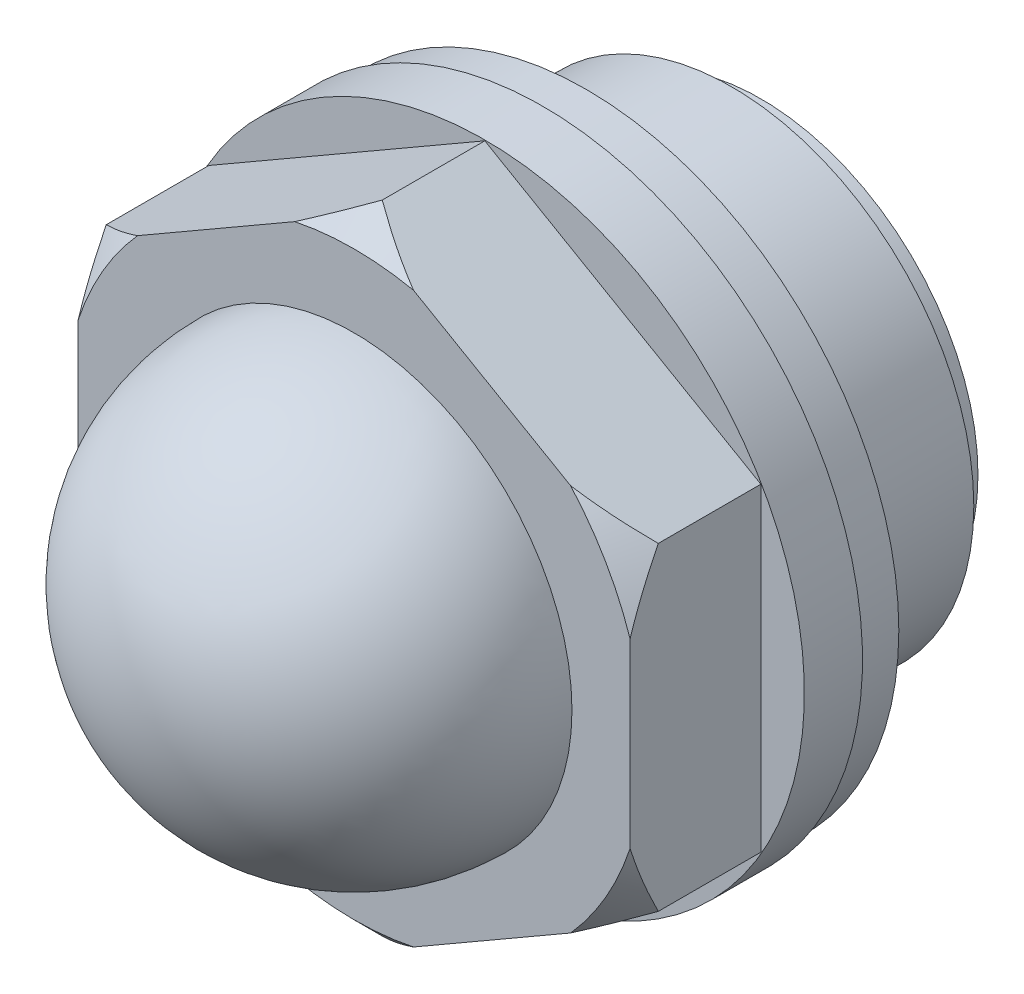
ISO-10303-21;
HEADER;
FILE_DESCRIPTION(('STEP AP214'),'2;1');
FILE_NAME('part.step','',(''),(''),'','','');
FILE_SCHEMA(('AUTOMOTIVE_DESIGN { 1 0 10303 214 1 1 1 1 }'));
ENDSEC;
DATA;
#1=APPLICATION_CONTEXT('core data for automotive mechanical design processes');
#2=APPLICATION_PROTOCOL_DEFINITION('international standard','automotive_design',2000,#1);
#3=PRODUCT_CONTEXT('',#1,'mechanical');
#4=PRODUCT('Part','Part','',(#3));
#5=PRODUCT_RELATED_PRODUCT_CATEGORY('part','',(#4));
#6=PRODUCT_DEFINITION_FORMATION('','',#4);
#7=PRODUCT_DEFINITION_CONTEXT('part definition',#1,'design');
#8=PRODUCT_DEFINITION('design','',#6,#7);
#9=PRODUCT_DEFINITION_SHAPE('','',#8);
#10=(LENGTH_UNIT() NAMED_UNIT(*) SI_UNIT(.MILLI.,.METRE.));
#11=(NAMED_UNIT(*) PLANE_ANGLE_UNIT() SI_UNIT($,.RADIAN.));
#12=(NAMED_UNIT(*) SI_UNIT($,.STERADIAN.) SOLID_ANGLE_UNIT());
#13=UNCERTAINTY_MEASURE_WITH_UNIT(LENGTH_MEASURE(1.E-05),#10,'distance_accuracy_value','');
#14=(GEOMETRIC_REPRESENTATION_CONTEXT(3) GLOBAL_UNCERTAINTY_ASSIGNED_CONTEXT((#13)) GLOBAL_UNIT_ASSIGNED_CONTEXT((#10,
#11,#12)) REPRESENTATION_CONTEXT('',''));
#15=CARTESIAN_POINT('',(0.,0.,0.));
#16=DIRECTION('',(0.,0.,1.));
#17=DIRECTION('',(1.,0.,0.));
#18=AXIS2_PLACEMENT_3D('',#15,#16,#17);
#19=CARTESIAN_POINT('',(0.,0.,-6.));
#20=DIRECTION('',(0.,0.,-1.));
#21=DIRECTION('',(-1.,0.,0.));
#22=AXIS2_PLACEMENT_3D('',#19,#20,#21);
#23=PLANE('',#22);
#24=CARTESIAN_POINT('',(0.,0.,-6.));
#25=DIRECTION('',(0.,0.,-1.));
#26=DIRECTION('',(-1.,0.,0.));
#27=AXIS2_PLACEMENT_3D('',#24,#25,#26);
#28=CIRCLE('',#27,7.475);
#29=CARTESIAN_POINT('',(-7.475,0.,-6.));
#30=VERTEX_POINT('',#29);
#31=EDGE_CURVE('E9',#30,#30,#28,.T.);
#32=ORIENTED_EDGE('',*,*,#31,.T.);
#33=EDGE_LOOP('',(#32));
#34=FACE_BOUND('',#33,.T.);
#35=ADVANCED_FACE('F14',(#34),#23,.T.);
#36=CARTESIAN_POINT('',(0.,0.,-10.25));
#37=DIRECTION('',(0.,0.,-1.));
#38=DIRECTION('',(-1.,0.,0.));
#39=AXIS2_PLACEMENT_3D('',#36,#37,#38);
#40=CYLINDRICAL_SURFACE('',#39,7.475);
#41=ORIENTED_EDGE('',*,*,#31,.F.);
#42=EDGE_LOOP('',(#41));
#43=FACE_BOUND('',#42,.T.);
#44=CARTESIAN_POINT('',(0.,0.,-5.));
#45=DIRECTION('',(0.,0.,-1.));
#46=DIRECTION('',(-1.,0.,0.));
#47=AXIS2_PLACEMENT_3D('',#44,#45,#46);
#48=CIRCLE('',#47,7.475);
#49=CARTESIAN_POINT('',(-7.475,0.,-5.));
#50=VERTEX_POINT('',#49);
#51=EDGE_CURVE('E21',#50,#50,#48,.T.);
#52=ORIENTED_EDGE('',*,*,#51,.T.);
#53=EDGE_LOOP('',(#52));
#54=FACE_BOUND('',#53,.T.);
#55=ADVANCED_FACE('F249',(#43,#54),#40,.T.);
#56=CARTESIAN_POINT('',(0.,7.475,-5.));
#57=DIRECTION('',(0.,0.,-1.));
#58=DIRECTION('',(-1.,0.,0.));
#59=AXIS2_PLACEMENT_3D('',#56,#57,#58);
#60=PLANE('',#59);
#61=CARTESIAN_POINT('',(0.,0.,-5.));
#62=DIRECTION('',(0.,0.,-1.));
#63=DIRECTION('',(-1.,0.,0.));
#64=AXIS2_PLACEMENT_3D('',#61,#62,#63);
#65=CIRCLE('',#64,8.331);
#66=CARTESIAN_POINT('',(-8.331,0.,-5.));
#67=VERTEX_POINT('',#66);
#68=EDGE_CURVE('E262',#67,#67,#65,.T.);
#69=ORIENTED_EDGE('',*,*,#68,.T.);
#70=EDGE_LOOP('',(#69));
#71=FACE_BOUND('',#70,.T.);
#72=ORIENTED_EDGE('',*,*,#51,.F.);
#73=EDGE_LOOP('',(#72));
#74=FACE_BOUND('',#73,.T.);
#75=ADVANCED_FACE('F255',(#71,#74),#60,.T.);
#76=CARTESIAN_POINT('',(0.,0.,-10.25));
#77=DIRECTION('',(0.,0.,-1.));
#78=DIRECTION('',(-1.,0.,0.));
#79=AXIS2_PLACEMENT_3D('',#76,#77,#78);
#80=CYLINDRICAL_SURFACE('',#79,8.331);
#81=ORIENTED_EDGE('',*,*,#68,.F.);
#82=EDGE_LOOP('',(#81));
#83=FACE_BOUND('',#82,.T.);
#84=CARTESIAN_POINT('',(0.,0.,0.));
#85=DIRECTION('',(0.,0.,-1.));
#86=DIRECTION('',(-1.,0.,0.));
#87=AXIS2_PLACEMENT_3D('',#84,#85,#86);
#88=CIRCLE('',#87,8.331);
#89=CARTESIAN_POINT('',(-8.331,0.,0.));
#90=VERTEX_POINT('',#89);
#91=EDGE_CURVE('E264',#90,#90,#88,.T.);
#92=ORIENTED_EDGE('',*,*,#91,.T.);
#93=EDGE_LOOP('',(#92));
#94=FACE_BOUND('',#93,.T.);
#95=ADVANCED_FACE('F494',(#83,#94),#80,.T.);
#96=CARTESIAN_POINT('',(0.,10.75,0.));
#97=DIRECTION('',(0.,0.,1.));
#98=DIRECTION('',(1.,0.,0.));
#99=AXIS2_PLACEMENT_3D('',#96,#97,#98);
#100=PLANE('',#99);
#101=ORIENTED_EDGE('',*,*,#91,.F.);
#102=EDGE_LOOP('',(#101));
#103=FACE_BOUND('',#102,.T.);
#104=CARTESIAN_POINT('',(0.,0.,0.));
#105=DIRECTION('',(0.,0.,-1.));
#106=DIRECTION('',(-1.,0.,0.));
#107=AXIS2_PLACEMENT_3D('',#104,#105,#106);
#108=CIRCLE('',#107,10.75);
#109=CARTESIAN_POINT('',(-10.75,0.,0.));
#110=VERTEX_POINT('',#109);
#111=EDGE_CURVE('E269',#110,#110,#108,.T.);
#112=ORIENTED_EDGE('',*,*,#111,.T.);
#113=EDGE_LOOP('',(#112));
#114=FACE_BOUND('',#113,.T.);
#115=ADVANCED_FACE('F484',(#103,#114),#100,.F.);
#116=CARTESIAN_POINT('',(0.,0.,-10.25));
#117=DIRECTION('',(0.,0.,-1.));
#118=DIRECTION('',(-1.,0.,0.));
#119=AXIS2_PLACEMENT_3D('',#116,#117,#118);
#120=CYLINDRICAL_SURFACE('',#119,10.75);
#121=CARTESIAN_POINT('',(0.,0.,1.5));
#122=DIRECTION('',(0.,0.,-1.));
#123=DIRECTION('',(-1.,0.,0.));
#124=AXIS2_PLACEMENT_3D('',#121,#122,#123);
#125=CIRCLE('',#124,10.75);
#126=CARTESIAN_POINT('',(-10.75,0.,1.5));
#127=VERTEX_POINT('',#126);
#128=EDGE_CURVE('E272',#127,#127,#125,.T.);
#129=ORIENTED_EDGE('',*,*,#128,.T.);
#130=EDGE_LOOP('',(#129));
#131=FACE_BOUND('',#130,.T.);
#132=ORIENTED_EDGE('',*,*,#111,.F.);
#133=EDGE_LOOP('',(#132));
#134=FACE_BOUND('',#133,.T.);
#135=ADVANCED_FACE('F474',(#131,#134),#120,.T.);
#136=CARTESIAN_POINT('',(0.,10.75,1.5));
#137=DIRECTION('',(0.,0.,-1.));
#138=DIRECTION('',(-1.,0.,0.));
#139=AXIS2_PLACEMENT_3D('',#136,#137,#138);
#140=PLANE('',#139);
#141=CARTESIAN_POINT('',(0.,0.,1.5));
#142=DIRECTION('',(0.,0.,-1.));
#143=DIRECTION('',(-1.,0.,0.));
#144=AXIS2_PLACEMENT_3D('',#141,#142,#143);
#145=CIRCLE('',#144,11.);
#146=CARTESIAN_POINT('',(-11.,0.,1.5));
#147=VERTEX_POINT('',#146);
#148=EDGE_CURVE('E275',#147,#147,#145,.T.);
#149=ORIENTED_EDGE('',*,*,#148,.T.);
#150=EDGE_LOOP('',(#149));
#151=FACE_BOUND('',#150,.T.);
#152=ORIENTED_EDGE('',*,*,#128,.F.);
#153=EDGE_LOOP('',(#152));
#154=FACE_BOUND('',#153,.T.);
#155=ADVANCED_FACE('F465',(#151,#154),#140,.T.);
#156=CARTESIAN_POINT('',(0.,0.,-10.25));
#157=DIRECTION('',(0.,0.,-1.));
#158=DIRECTION('',(-1.,0.,0.));
#159=AXIS2_PLACEMENT_3D('',#156,#157,#158);
#160=CYLINDRICAL_SURFACE('',#159,11.);
#161=ORIENTED_EDGE('',*,*,#148,.F.);
#162=EDGE_LOOP('',(#161));
#163=FACE_BOUND('',#162,.T.);
#164=CARTESIAN_POINT('',(0.,0.,3.5));
#165=DIRECTION('',(0.,0.,-1.));
#166=DIRECTION('',(-1.,0.,0.));
#167=AXIS2_PLACEMENT_3D('',#164,#165,#166);
#168=CIRCLE('',#167,11.);
#169=CARTESIAN_POINT('',(-11.,0.,3.5));
#170=VERTEX_POINT('',#169);
#171=EDGE_CURVE('E278',#170,#170,#168,.T.);
#172=ORIENTED_EDGE('',*,*,#171,.T.);
#173=EDGE_LOOP('',(#172));
#174=FACE_BOUND('',#173,.T.);
#175=ADVANCED_FACE('F246',(#163,#174),#160,.T.);
#176=CARTESIAN_POINT('',(0.,10.9696551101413,3.5));
#177=DIRECTION('',(0.,0.,-1.));
#178=DIRECTION('',(-1.,0.,0.));
#179=AXIS2_PLACEMENT_3D('',#176,#177,#178);
#180=PLANE('',#179);
#181=ORIENTED_EDGE('',*,*,#171,.F.);
#182=EDGE_LOOP('',(#181));
#183=FACE_BOUND('',#182,.T.);
#184=DIRECTION('',(0.,1.,0.));
#185=VECTOR('',#184,1.);
#186=CARTESIAN_POINT('',(-9.49999999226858,-5.4848275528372,3.5));
#187=LINE('',#186,#185);
#188=CARTESIAN_POINT('',(-9.49999999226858,-5.4848275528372,3.5));
#189=VERTEX_POINT('',#188);
#190=CARTESIAN_POINT('',(-9.49999999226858,5.4848275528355,3.5));
#191=VERTEX_POINT('',#190);
#192=EDGE_CURVE('E123',#189,#191,#187,.T.);
#193=ORIENTED_EDGE('',*,*,#192,.T.);
#194=DIRECTION('',(0.866025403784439,0.5,0.));
#195=VECTOR('',#194,1.);
#196=CARTESIAN_POINT('',(-9.49999999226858,5.4848275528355,3.5));
#197=LINE('',#196,#195);
#198=CARTESIAN_POINT('',(-3.86496390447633E-12,10.969655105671,3.5));
#199=VERTEX_POINT('',#198);
#200=EDGE_CURVE('E108',#191,#199,#197,.T.);
#201=ORIENTED_EDGE('',*,*,#200,.T.);
#202=DIRECTION('',(0.866025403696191,-0.50000000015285,0.));
#203=VECTOR('',#202,1.);
#204=CARTESIAN_POINT('',(-3.86496390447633E-12,10.969655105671,3.5));
#205=LINE('',#204,#203);
#206=CARTESIAN_POINT('',(9.49999999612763,5.48482754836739,3.5));
#207=VERTEX_POINT('',#206);
#208=EDGE_CURVE('E120',#199,#207,#205,.T.);
#209=ORIENTED_EDGE('',*,*,#208,.T.);
#210=DIRECTION('',(0.,-1.,0.));
#211=VECTOR('',#210,1.);
#212=CARTESIAN_POINT('',(9.49999999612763,5.48482754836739,3.5));
#213=LINE('',#212,#211);
#214=CARTESIAN_POINT('',(9.49999999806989,-5.48482755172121,3.5));
#215=VERTEX_POINT('',#214);
#216=EDGE_CURVE('E128',#207,#215,#213,.T.);
#217=ORIENTED_EDGE('',*,*,#216,.T.);
#218=DIRECTION('',(-0.866025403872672,-0.499999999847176,0.));
#219=VECTOR('',#218,1.);
#220=CARTESIAN_POINT('',(9.49999999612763,-5.4848275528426,3.5));
#221=LINE('',#220,#219);
#222=CARTESIAN_POINT('',(-1.5334955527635E-12,-10.969655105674,3.5));
#223=VERTEX_POINT('',#222);
#224=EDGE_CURVE('E28',#215,#223,#221,.T.);
#225=ORIENTED_EDGE('',*,*,#224,.T.);
#226=DIRECTION('',(-0.866025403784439,0.5,0.));
#227=VECTOR('',#226,1.);
#228=CARTESIAN_POINT('',(-1.5334955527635E-12,-10.969655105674,3.5));
#229=LINE('',#228,#227);
#230=EDGE_CURVE('E134',#223,#189,#229,.T.);
#231=ORIENTED_EDGE('',*,*,#230,.T.);
#232=EDGE_LOOP('',(#193,#201,#209,#217,#225,#231));
#233=FACE_BOUND('',#232,.T.);
#234=ADVANCED_FACE('F119',(#183,#233),#180,.F.);
#235=CARTESIAN_POINT('',(-9.49999999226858,5.4848275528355,3.5));
#236=DIRECTION('',(0.5,-0.866025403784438,0.));
#237=DIRECTION('',(-0.866025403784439,-0.5,0.));
#238=AXIS2_PLACEMENT_3D('',#235,#236,#237);
#239=PLANE('',#238);
#240=DIRECTION('',(0.,0.,1.));
#241=VECTOR('',#240,1.);
#242=CARTESIAN_POINT('',(-3.86496390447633E-12,10.969655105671,3.5));
#243=LINE('',#242,#241);
#244=CARTESIAN_POINT('',(-3.86496390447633E-12,10.969655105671,7.03034489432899));
#245=VERTEX_POINT('',#244);
#246=EDGE_CURVE('E104',#199,#245,#243,.T.);
#247=ORIENTED_EDGE('',*,*,#246,.F.);
#248=ORIENTED_EDGE('',*,*,#200,.F.);
#249=DIRECTION('',(0.,0.,1.));
#250=VECTOR('',#249,1.);
#251=CARTESIAN_POINT('',(-9.49999999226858,5.4848275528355,3.5));
#252=LINE('',#251,#250);
#253=CARTESIAN_POINT('',(-9.49999999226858,5.4848275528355,7.03034489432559));
#254=VERTEX_POINT('',#253);
#255=EDGE_CURVE('E137',#191,#254,#252,.T.);
#256=ORIENTED_EDGE('',*,*,#255,.T.);
#257=CARTESIAN_POINT('',(-3.88650780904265,8.72577877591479,8.44781919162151));
#258=CARTESIAN_POINT('',(-3.99076417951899,8.66558633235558,8.46038988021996));
#259=CARTESIAN_POINT('',(-4.09521487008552,8.60528169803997,8.47072263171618));
#260=CARTESIAN_POINT('',(-4.30438010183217,8.48452009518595,8.48683737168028));
#261=CARTESIAN_POINT('',(-4.40909464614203,8.42406312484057,8.49261930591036));
#262=CARTESIAN_POINT('',(-4.7233113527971,8.24265002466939,8.50302181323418));
#263=CARTESIAN_POINT('',(-4.93301802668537,8.12157582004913,8.50071508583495));
#264=CARTESIAN_POINT('',(-5.34769472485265,7.88216211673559,8.47791106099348));
#265=CARTESIAN_POINT('',(-5.5526794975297,7.76381410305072,8.45775761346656));
#266=CARTESIAN_POINT('',(-5.96082669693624,7.52817020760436,8.40051808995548));
#267=CARTESIAN_POINT('',(-6.16398926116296,7.41087424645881,8.36343330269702));
#268=CARTESIAN_POINT('',(-6.67178190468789,7.11770002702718,8.25042007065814));
#269=CARTESIAN_POINT('',(-6.97472889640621,6.94279349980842,8.16432263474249));
#270=CARTESIAN_POINT('',(-7.57318986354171,6.59727189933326,7.96169160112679));
#271=CARTESIAN_POINT('',(-7.86869179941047,6.42666377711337,7.84511178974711));
#272=CARTESIAN_POINT('',(-8.46039122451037,6.0850459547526,7.58350665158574));
#273=CARTESIAN_POINT('',(-8.75633407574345,5.91418326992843,7.4377210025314));
#274=CARTESIAN_POINT('',(-9.19346873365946,5.66180345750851,7.20399268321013));
#275=CARTESIAN_POINT('',(-9.33780587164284,5.57847037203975,7.12372709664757));
#276=CARTESIAN_POINT('',(-9.62448818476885,5.41295426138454,6.95869978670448));
#277=CARTESIAN_POINT('',(-9.76683394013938,5.33077090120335,6.87393940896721));
#278=CARTESIAN_POINT('',(-9.90826977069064,5.2491128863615,6.78719500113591));
#279=B_SPLINE_CURVE_WITH_KNOTS('',3,(#257,#258,#259,#260,#261,#262,#263,#264,#265,#266,#267,
#268,#269,#270,#271,#272,#273,#274,#275,#276,#277,#278),.UNSPECIFIED.,.F.,.F.,(4,2,2,2,2,2,2,2,
2,2,4),(0.,0.363077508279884,0.726159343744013,1.45186638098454,2.16388835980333,
2.87585615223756,3.95485073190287,5.03549073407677,6.14915016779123,6.70405849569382,
7.25880162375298),.UNSPECIFIED.);
#280=CARTESIAN_POINT('',(-7.45416347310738,6.6659918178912,8.));
#281=VERTEX_POINT('',#280);
#282=EDGE_CURVE('E225',#281,#254,#279,.T.);
#283=ORIENTED_EDGE('',*,*,#282,.F.);
#284=DIRECTION('',(0.866025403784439,0.5,0.));
#285=VECTOR('',#284,1.);
#286=CARTESIAN_POINT('',(-9.49999999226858,5.4848275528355,8.));
#287=LINE('',#286,#285);
#288=CARTESIAN_POINT('',(-2.04583651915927,9.7884908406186,8.));
#289=VERTEX_POINT('',#288);
#290=EDGE_CURVE('E298',#281,#289,#287,.T.);
#291=ORIENTED_EDGE('',*,*,#290,.T.);
#292=CARTESIAN_POINT('',(0.000199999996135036,10.9697705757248,7.03022942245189));
#293=CARTESIAN_POINT('',(-0.16497200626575,10.8744084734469,7.125577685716));
#294=CARTESIAN_POINT('',(-0.331450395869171,10.7782921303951,7.21798306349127));
#295=CARTESIAN_POINT('',(-0.666865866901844,10.5846399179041,7.39577132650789));
#296=CARTESIAN_POINT('',(-0.835798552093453,10.4871065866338,7.48116529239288));
#297=CARTESIAN_POINT('',(-1.17654218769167,10.2903781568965,7.64412782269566));
#298=CARTESIAN_POINT('',(-1.34835383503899,10.1911826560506,7.72169445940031));
#299=CARTESIAN_POINT('',(-1.69509608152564,9.9909909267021,7.86794743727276));
#300=CARTESIAN_POINT('',(-1.87003127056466,9.88999204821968,7.93661923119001));
#301=CARTESIAN_POINT('',(-2.0463912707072,9.78817055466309,8.0002));
#302=B_SPLINE_CURVE_WITH_KNOTS('',3,(#292,#293,#294,#295,#296,#297,#298,#299,#300,#301),
.UNSPECIFIED.,.F.,.F.,(4,2,2,2,4),(0.,0.639712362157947,1.27839345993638,1.91723147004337,
2.55710143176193),.UNSPECIFIED.);
#303=EDGE_CURVE('E110',#245,#289,#302,.T.);
#304=ORIENTED_EDGE('',*,*,#303,.F.);
#305=EDGE_LOOP('',(#247,#248,#256,#283,#291,#304));
#306=FACE_BOUND('',#305,.T.);
#307=ADVANCED_FACE('F106',(#306),#239,.F.);
#308=CARTESIAN_POINT('',(-3.86496390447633E-12,10.969655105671,3.5));
#309=DIRECTION('',(-0.50000000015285,-0.866025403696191,0.));
#310=DIRECTION('',(-0.866025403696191,0.50000000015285,0.));
#311=AXIS2_PLACEMENT_3D('',#308,#309,#310);
#312=PLANE('',#311);
#313=DIRECTION('',(0.,0.,1.));
#314=VECTOR('',#313,1.);
#315=CARTESIAN_POINT('',(9.49999999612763,5.48482754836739,3.5));
#316=LINE('',#315,#314);
#317=CARTESIAN_POINT('',(9.49999999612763,5.48482754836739,7.03034489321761));
#318=VERTEX_POINT('',#317);
#319=EDGE_CURVE('E114',#207,#318,#316,.T.);
#320=ORIENTED_EDGE('',*,*,#319,.F.);
#321=ORIENTED_EDGE('',*,*,#208,.F.);
#322=ORIENTED_EDGE('',*,*,#246,.T.);
#323=CARTESIAN_POINT('',(5.62744002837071,7.7206510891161,8.44612463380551));
#324=CARTESIAN_POINT('',(5.5232333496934,7.78081484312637,8.45888991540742));
#325=CARTESIAN_POINT('',(5.41882944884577,7.84109246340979,8.46942139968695));
#326=CARTESIAN_POINT('',(5.20975131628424,7.96180377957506,8.48594001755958));
#327=CARTESIAN_POINT('',(5.10507708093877,8.02223747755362,8.49192708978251));
#328=CARTESIAN_POINT('',(4.790968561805,8.20358811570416,8.50295158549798));
#329=CARTESIAN_POINT('',(4.58131953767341,8.32462903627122,8.50106822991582));
#330=CARTESIAN_POINT('',(4.16673966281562,8.56398683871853,8.47910352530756));
#331=CARTESIAN_POINT('',(3.96179455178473,8.68231195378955,8.45936693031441));
#332=CARTESIAN_POINT('',(3.55370330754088,8.91792354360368,8.40294779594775));
#333=CARTESIAN_POINT('',(3.35055703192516,9.03521010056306,8.36626661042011));
#334=CARTESIAN_POINT('',(2.8435182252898,9.32794909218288,8.25440004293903));
#335=CARTESIAN_POINT('',(2.54128241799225,9.50244501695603,8.16911639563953));
#336=CARTESIAN_POINT('',(1.94418390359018,9.84718000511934,7.96816990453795));
#337=CARTESIAN_POINT('',(1.64933310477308,10.0174121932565,7.85246107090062));
#338=CARTESIAN_POINT('',(1.05891214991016,10.3582918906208,7.59264131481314));
#339=CARTESIAN_POINT('',(0.763595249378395,10.5287931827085,7.44777064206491));
#340=CARTESIAN_POINT('',(0.327374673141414,10.7806452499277,7.21540819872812));
#341=CARTESIAN_POINT('',(0.183336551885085,10.8638056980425,7.13559538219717));
#342=CARTESIAN_POINT('',(-0.102753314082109,11.0289797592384,6.97147085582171));
#343=CARTESIAN_POINT('',(-0.244805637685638,11.1109937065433,6.88716049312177));
#344=CARTESIAN_POINT('',(-0.385950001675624,11.1924834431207,6.800864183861));
#345=B_SPLINE_CURVE_WITH_KNOTS('',3,(#323,#324,#325,#326,#327,#328,#329,#330,#331,#332,#333,
#334,#335,#336,#337,#338,#339,#340,#341,#342,#343,#344),.UNSPECIFIED.,.F.,.F.,(4,2,2,2,2,2,2,2,
2,2,4),(0.,0.362967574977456,0.725940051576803,1.45143701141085,2.16321655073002,
2.87493922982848,3.9509658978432,5.02862850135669,6.13921661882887,6.69260270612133,
7.24582395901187),.UNSPECIFIED.);
#346=CARTESIAN_POINT('',(2.04583651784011,9.7884908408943,8.));
#347=VERTEX_POINT('',#346);
#348=EDGE_CURVE('E212',#347,#245,#345,.T.);
#349=ORIENTED_EDGE('',*,*,#348,.F.);
#350=DIRECTION('',(0.866025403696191,-0.50000000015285,0.));
#351=VECTOR('',#350,1.);
#352=CARTESIAN_POINT('',(-3.86496390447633E-12,10.969655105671,8.));
#353=LINE('',#352,#351);
#354=CARTESIAN_POINT('',(7.45416347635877,6.6659918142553,8.));
#355=VERTEX_POINT('',#354);
#356=EDGE_CURVE('E300',#347,#355,#353,.T.);
#357=ORIENTED_EDGE('',*,*,#356,.T.);
#358=CARTESIAN_POINT('',(9.50019999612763,5.48471207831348,7.0302294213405));
#359=CARTESIAN_POINT('',(9.33502798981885,5.58007418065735,7.12557768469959));
#360=CARTESIAN_POINT('',(9.16854960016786,5.6761905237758,7.21798306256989));
#361=CARTESIAN_POINT('',(8.83313412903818,5.86984273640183,7.39577132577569));
#362=CARTESIAN_POINT('',(8.66420144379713,5.96737606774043,7.48116529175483));
#363=CARTESIAN_POINT('',(8.32345780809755,6.16410449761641,7.64412782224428));
#364=CARTESIAN_POINT('',(8.15164616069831,6.26329999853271,7.72169445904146));
#365=CARTESIAN_POINT('',(7.80490391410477,6.4634917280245,7.86794743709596));
#366=CARTESIAN_POINT('',(7.62996872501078,6.56449060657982,7.93661923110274));
#367=CARTESIAN_POINT('',(7.45360872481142,6.6663121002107,8.0002));
#368=B_SPLINE_CURVE_WITH_KNOTS('',3,(#358,#359,#360,#361,#362,#363,#364,#365,#366,#367),
.UNSPECIFIED.,.F.,.F.,(4,2,2,2,4),(0.,0.639712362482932,1.27839346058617,1.91723147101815,
2.55710143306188),.UNSPECIFIED.);
#369=EDGE_CURVE('E219',#318,#355,#368,.T.);
#370=ORIENTED_EDGE('',*,*,#369,.F.);
#371=EDGE_LOOP('',(#320,#321,#322,#349,#357,#370));
#372=FACE_BOUND('',#371,.T.);
#373=ADVANCED_FACE('F126',(#372),#312,.F.);
#374=CARTESIAN_POINT('',(9.49999999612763,5.48482754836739,3.5));
#375=DIRECTION('',(-1.,0.,0.));
#376=DIRECTION('',(0.,0.,1.));
#377=AXIS2_PLACEMENT_3D('',#374,#375,#376);
#378=PLANE('',#377);
#379=DIRECTION('',(0.,0.,1.));
#380=VECTOR('',#379,1.);
#381=CARTESIAN_POINT('',(9.49999999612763,-5.4848275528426,3.5));
#382=LINE('',#381,#380);
#383=CARTESIAN_POINT('',(9.49999999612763,-5.4848275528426,7.03034489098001));
#384=VERTEX_POINT('',#383);
#385=EDGE_CURVE('E144',#215,#384,#382,.T.);
#386=ORIENTED_EDGE('',*,*,#385,.F.);
#387=ORIENTED_EDGE('',*,*,#216,.F.);
#388=ORIENTED_EDGE('',*,*,#319,.T.);
#389=CARTESIAN_POINT('',(9.49999999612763,-11.6492332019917,2.96821254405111));
#390=CARTESIAN_POINT('',(9.49999999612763,-11.3685574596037,3.18568017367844));
#391=CARTESIAN_POINT('',(9.49999999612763,-11.0863926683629,3.4012557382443));
#392=CARTESIAN_POINT('',(9.49999999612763,-10.5184682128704,3.82775169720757));
#393=CARTESIAN_POINT('',(9.49999999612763,-10.2327077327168,4.03867100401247));
#394=CARTESIAN_POINT('',(9.49999999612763,-9.65488982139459,4.45648333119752));
#395=CARTESIAN_POINT('',(9.49999999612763,-9.3628008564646,4.66333288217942));
#396=CARTESIAN_POINT('',(9.49999999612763,-8.7738025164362,5.07002702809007));
#397=CARTESIAN_POINT('',(9.49999999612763,-8.47689347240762,5.26987210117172));
#398=CARTESIAN_POINT('',(9.49999999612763,-7.85766241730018,5.67384153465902));
#399=CARTESIAN_POINT('',(9.49999999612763,-7.53495567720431,5.87737910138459));
#400=CARTESIAN_POINT('',(9.49999999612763,-6.88195215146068,6.27210243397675));
#401=CARTESIAN_POINT('',(9.49999999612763,-6.55165407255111,6.46328607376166));
#402=CARTESIAN_POINT('',(9.49999999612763,-5.8833303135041,6.82925180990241));
#403=CARTESIAN_POINT('',(9.49999999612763,-5.54533116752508,7.00408198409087));
#404=CARTESIAN_POINT('',(9.49999999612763,-4.85965236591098,7.33342319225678));
#405=CARTESIAN_POINT('',(9.49999999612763,-4.51197744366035,7.48794395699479));
#406=CARTESIAN_POINT('',(9.49999999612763,-3.84327853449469,7.75611414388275));
#407=CARTESIAN_POINT('',(9.49999999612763,-3.52330405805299,7.87235412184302));
#408=CARTESIAN_POINT('',(9.49999999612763,-2.87502962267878,8.07923762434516));
#409=CARTESIAN_POINT('',(9.49999999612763,-2.54672914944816,8.16987956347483));
#410=CARTESIAN_POINT('',(9.49999999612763,-1.88958743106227,8.31907589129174));
#411=CARTESIAN_POINT('',(9.49999999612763,-1.56088388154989,8.37822644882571));
#412=CARTESIAN_POINT('',(9.49999999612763,-0.899170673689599,8.4631757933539));
#413=CARTESIAN_POINT('',(9.49999999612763,-0.566161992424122,8.48898201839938));
#414=CARTESIAN_POINT('',(9.49999999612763,0.0850717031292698,8.50493457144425));
#415=CARTESIAN_POINT('',(9.49999999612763,0.403257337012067,8.49669708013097));
#416=CARTESIAN_POINT('',(9.49999999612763,1.03723516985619,8.44877541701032));
#417=CARTESIAN_POINT('',(9.49999999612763,1.35302715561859,8.40908847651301));
#418=CARTESIAN_POINT('',(9.49999999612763,1.98529191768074,8.29986857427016));
#419=CARTESIAN_POINT('',(9.49999999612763,2.30167072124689,8.22980096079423));
#420=CARTESIAN_POINT('',(9.49999999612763,2.92742689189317,8.0637670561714));
#421=CARTESIAN_POINT('',(9.49999999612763,3.23680457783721,7.96780194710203));
#422=CARTESIAN_POINT('',(9.49999999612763,3.86173395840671,7.74946954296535));
#423=CARTESIAN_POINT('',(9.49999999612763,4.17693322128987,7.62610539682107));
#424=CARTESIAN_POINT('',(9.49999999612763,4.79924684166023,7.3602845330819));
#425=CARTESIAN_POINT('',(9.49999999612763,5.1063575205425,7.21781930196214));
#426=CARTESIAN_POINT('',(9.49999999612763,5.71392872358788,6.91717227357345));
#427=CARTESIAN_POINT('',(9.49999999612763,6.01436526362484,6.75894240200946));
#428=CARTESIAN_POINT('',(9.49999999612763,6.60836259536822,6.43024309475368));
#429=CARTESIAN_POINT('',(9.49999999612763,6.90192442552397,6.25977552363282));
#430=CARTESIAN_POINT('',(9.49999999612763,7.46874231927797,5.91763163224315));
#431=CARTESIAN_POINT('',(9.49999999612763,7.74228596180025,5.74642921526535));
#432=CARTESIAN_POINT('',(9.49999999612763,8.2846728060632,5.39671243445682));
#433=CARTESIAN_POINT('',(9.49999999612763,8.55351565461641,5.21819752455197));
#434=CARTESIAN_POINT('',(9.49999999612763,9.08496081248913,4.85660526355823));
#435=CARTESIAN_POINT('',(9.49999999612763,9.3475958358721,4.67357582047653));
#436=CARTESIAN_POINT('',(9.49999999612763,9.86925916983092,4.30259181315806));
#437=CARTESIAN_POINT('',(9.49999999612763,10.1282884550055,4.11463862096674));
#438=CARTESIAN_POINT('',(9.49999999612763,10.385804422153,3.92466933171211));
#439=B_SPLINE_CURVE_WITH_KNOTS('',3,(#389,#390,#391,#392,#393,#394,#395,#396,#397,#398,#399,
#400,#401,#402,#403,#404,#405,#406,#407,#408,#409,#410,#411,#412,#413,#414,#415,#416,#417,#418,
#419,#420,#421,#422,#423,#424,#425,#426,#427,#428,#429,#430,#431,#432,#433,#434,#435,#436,#437,
#438),.UNSPECIFIED.,.F.,.F.,(4,2,2,2,2,2,2,2,2,2,2,2,2,2,2,2,2,2,2,2,2,2,2,2,4),(0.,
1.06521348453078,2.13067320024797,3.20433132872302,4.2779160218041,5.42229419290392,
6.56686878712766,7.70796507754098,8.84851263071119,9.86894085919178,10.8894322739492,
11.889847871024,12.8900402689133,13.8433087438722,14.7966611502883,15.7675190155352,
16.7383325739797,17.7530013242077,18.7681238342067,19.7864426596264,20.8046066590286,
21.7725756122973,22.7406169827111,23.7009161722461,24.6609505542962),.UNSPECIFIED.);
#440=CARTESIAN_POINT('',(9.49999999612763,3.12249901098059,8.));
#441=VERTEX_POINT('',#440);
#442=EDGE_CURVE('E204',#441,#318,#439,.T.);
#443=ORIENTED_EDGE('',*,*,#442,.F.);
#444=DIRECTION('',(0.,-1.,0.));
#445=VECTOR('',#444,1.);
#446=CARTESIAN_POINT('',(9.49999999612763,5.48482754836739,8.));
#447=LINE('',#446,#445);
#448=CARTESIAN_POINT('',(9.49999999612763,-3.1224990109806,8.));
#449=VERTEX_POINT('',#448);
#450=EDGE_CURVE('E326',#441,#449,#447,.T.);
#451=ORIENTED_EDGE('',*,*,#450,.T.);
#452=EDGE_CURVE('E334',#384,#449,#439,.T.);
#453=ORIENTED_EDGE('',*,*,#452,.F.);
#454=EDGE_LOOP('',(#386,#387,#388,#443,#451,#453));
#455=FACE_BOUND('',#454,.T.);
#456=ADVANCED_FACE('F245',(#455),#378,.F.);
#457=CARTESIAN_POINT('',(9.49999999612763,-5.4848275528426,3.5));
#458=DIRECTION('',(-0.499999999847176,0.866025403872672,0.));
#459=DIRECTION('',(0.866025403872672,0.499999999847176,0.));
#460=AXIS2_PLACEMENT_3D('',#457,#458,#459);
#461=PLANE('',#460);
#462=DIRECTION('',(-0.866025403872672,-0.499999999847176,0.));
#463=VECTOR('',#462,1.);
#464=CARTESIAN_POINT('',(9.49999999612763,-5.4848275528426,8.));
#465=LINE('',#464,#463);
#466=CARTESIAN_POINT('',(7.45416346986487,-6.665991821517,8.));
#467=VERTEX_POINT('',#466);
#468=CARTESIAN_POINT('',(2.04583652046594,-9.78849084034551,8.));
#469=VERTEX_POINT('',#468);
#470=EDGE_CURVE('E320',#467,#469,#465,.T.);
#471=ORIENTED_EDGE('',*,*,#470,.T.);
#472=CARTESIAN_POINT('',(-0.385950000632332,-11.1924834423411,6.80086418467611));
#473=CARTESIAN_POINT('',(-0.244805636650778,-11.110993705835,6.88716049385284));
#474=CARTESIAN_POINT('',(-0.102753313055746,-11.0289797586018,6.97147085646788));
#475=CARTESIAN_POINT('',(0.183336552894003,-10.8638056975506,7.135595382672));
#476=CARTESIAN_POINT('',(0.327374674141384,-10.7806452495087,7.21540819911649));
#477=CARTESIAN_POINT('',(0.76359525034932,-10.5287931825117,7.44777064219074));
#478=CARTESIAN_POINT('',(1.05891215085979,-10.3582918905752,7.59264131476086));
#479=CARTESIAN_POINT('',(1.64933310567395,-10.017412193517,7.85246107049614));
#480=CARTESIAN_POINT('',(1.94418390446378,-9.84718000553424,7.96816990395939));
#481=CARTESIAN_POINT('',(2.54128241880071,-9.50244501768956,8.16911639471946));
#482=CARTESIAN_POINT('',(2.84351822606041,-9.32794909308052,8.25440004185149));
#483=CARTESIAN_POINT('',(3.35055703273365,-9.03521010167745,8.36626660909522));
#484=CARTESIAN_POINT('',(3.55370330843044,-8.91792354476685,8.40294779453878));
#485=CARTESIAN_POINT('',(3.96179455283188,-8.68231195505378,8.45936692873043));
#486=CARTESIAN_POINT('',(4.16673966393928,-8.56398684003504,8.47910352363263));
#487=CARTESIAN_POINT('',(4.58131953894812,-8.32462903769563,8.50106822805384));
#488=CARTESIAN_POINT('',(4.79096856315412,-8.20358811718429,8.50295158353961));
#489=CARTESIAN_POINT('',(5.10507708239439,-8.02223747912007,8.49192708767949));
#490=CARTESIAN_POINT('',(5.20975131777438,-7.96180378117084,8.48594001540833));
#491=CARTESIAN_POINT('',(5.41882945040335,-7.84109246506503,8.46942139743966));
#492=CARTESIAN_POINT('',(5.52323335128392,-7.78081484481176,8.45888991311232));
#493=CARTESIAN_POINT('',(5.62744002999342,-7.720651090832,8.44612463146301));
#494=B_SPLINE_CURVE_WITH_KNOTS('',3,(#472,#473,#474,#475,#476,#477,#478,#479,#480,#481,#482,
#483,#484,#485,#486,#487,#488,#489,#490,#491,#492,#493),.UNSPECIFIED.,.F.,.F.,(4,2,2,2,2,2,2,2,
2,2,4),(0.,0.55322125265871,1.10660733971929,2.21719545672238,3.2948580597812,4.37088472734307,
5.08260740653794,5.79438694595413,6.51988390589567,6.88285638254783,7.24582395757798),.UNSPECIFIED.);
#495=CARTESIAN_POINT('',(-1.5334955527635E-12,-10.969655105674,7.0303448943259));
#496=VERTEX_POINT('',#495);
#497=EDGE_CURVE('E189',#496,#469,#494,.T.);
#498=ORIENTED_EDGE('',*,*,#497,.F.);
#499=DIRECTION('',(0.,0.,1.));
#500=VECTOR('',#499,1.);
#501=CARTESIAN_POINT('',(-1.5334955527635E-12,-10.969655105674,3.5));
#502=LINE('',#501,#500);
#503=EDGE_CURVE('E141',#223,#496,#502,.T.);
#504=ORIENTED_EDGE('',*,*,#503,.F.);
#505=ORIENTED_EDGE('',*,*,#224,.F.);
#506=ORIENTED_EDGE('',*,*,#385,.T.);
#507=CARTESIAN_POINT('',(7.45360871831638,-6.66631210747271,8.0002));
#508=CARTESIAN_POINT('',(7.62996871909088,-6.56449061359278,7.93661923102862));
#509=CARTESIAN_POINT('',(7.80490390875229,-6.4634917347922,7.86794743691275));
#510=CARTESIAN_POINT('',(8.1516461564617,-6.26330000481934,7.72169445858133));
#511=CARTESIAN_POINT('',(8.32345780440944,-6.16410450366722,7.64412782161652));
#512=CARTESIAN_POINT('',(8.66420144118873,-5.96737607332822,7.48116529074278));
#513=CARTESIAN_POINT('',(8.833134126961,-5.86984274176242,7.39577132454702));
#514=CARTESIAN_POINT('',(9.1685495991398,-5.67619052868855,7.21798306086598));
#515=CARTESIAN_POINT('',(9.33502798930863,-5.58007418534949,7.12557768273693));
#516=CARTESIAN_POINT('',(9.50019999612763,-5.48471208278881,7.0302294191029));
#517=B_SPLINE_CURVE_WITH_KNOTS('',3,(#507,#508,#509,#510,#511,#512,#513,#514,#515,#516),
.UNSPECIFIED.,.F.,.F.,(4,2,2,2,4),(0.,0.639869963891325,1.27870797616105,1.91738907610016,
2.55710144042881),.UNSPECIFIED.);
#518=EDGE_CURVE('E197',#467,#384,#517,.T.);
#519=ORIENTED_EDGE('',*,*,#518,.F.);
#520=EDGE_LOOP('',(#471,#498,#504,#505,#506,#519));
#521=FACE_BOUND('',#520,.T.);
#522=ADVANCED_FACE('F349',(#521),#461,.F.);
#523=CARTESIAN_POINT('',(-1.5334955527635E-12,-10.969655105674,3.5));
#524=DIRECTION('',(0.5,0.866025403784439,0.));
#525=DIRECTION('',(0.866025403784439,-0.5,0.));
#526=AXIS2_PLACEMENT_3D('',#523,#524,#525);
#527=PLANE('',#526);
#528=DIRECTION('',(-0.866025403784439,0.5,0.));
#529=VECTOR('',#528,1.);
#530=CARTESIAN_POINT('',(-1.5334955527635E-12,-10.969655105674,8.));
#531=LINE('',#530,#529);
#532=CARTESIAN_POINT('',(-2.04583651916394,-9.78849084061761,8.));
#533=VERTEX_POINT('',#532);
#534=CARTESIAN_POINT('',(-7.45416347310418,-6.66599181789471,8.));
#535=VERTEX_POINT('',#534);
#536=EDGE_CURVE('E322',#533,#535,#531,.T.);
#537=ORIENTED_EDGE('',*,*,#536,.T.);
#538=CARTESIAN_POINT('',(-9.90826977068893,-5.2491128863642,6.7871950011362));
#539=CARTESIAN_POINT('',(-9.76683394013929,-5.33077090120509,6.87393940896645));
#540=CARTESIAN_POINT('',(-9.6244881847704,-5.41295426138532,6.95869978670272));
#541=CARTESIAN_POINT('',(-9.33780587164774,-5.5784703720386,7.12372709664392));
#542=CARTESIAN_POINT('',(-9.19346873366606,-5.66180345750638,7.2039926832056));
#543=CARTESIAN_POINT('',(-8.75633407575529,-5.91418326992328,7.43772100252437));
#544=CARTESIAN_POINT('',(-8.46039122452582,-6.08504595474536,7.58350665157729));
#545=CARTESIAN_POINT('',(-7.86869179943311,-6.42666377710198,7.84511178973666));
#546=CARTESIAN_POINT('',(-7.57318986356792,-6.59727189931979,7.96169160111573));
#547=CARTESIAN_POINT('',(-6.97472889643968,-6.94279349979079,8.16432263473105));
#548=CARTESIAN_POINT('',(-6.67178190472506,-7.11770002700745,8.25042007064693));
#549=CARTESIAN_POINT('',(-6.16398926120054,-7.41087424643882,8.36343330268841));
#550=CARTESIAN_POINT('',(-5.96082669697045,-7.52817020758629,8.40051808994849));
#551=CARTESIAN_POINT('',(-5.55267949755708,-7.76381410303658,8.45775761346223));
#552=CARTESIAN_POINT('',(-5.34769472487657,-7.88216211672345,8.47791106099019));
#553=CARTESIAN_POINT('',(-4.93301802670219,-8.12157582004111,8.50071508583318));
#554=CARTESIAN_POINT('',(-4.72331135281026,-8.24265002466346,8.50302181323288));
#555=CARTESIAN_POINT('',(-4.40909464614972,-8.42406312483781,8.49261930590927));
#556=CARTESIAN_POINT('',(-4.30438010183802,-8.48452009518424,8.48683737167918));
#557=CARTESIAN_POINT('',(-4.09521487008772,-8.60528169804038,8.47072263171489));
#558=CARTESIAN_POINT('',(-3.99076417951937,-8.66558633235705,8.46038988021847));
#559=CARTESIAN_POINT('',(-3.88650780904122,-8.72577877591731,8.44781919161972));
#560=B_SPLINE_CURVE_WITH_KNOTS('',3,(#538,#539,#540,#541,#542,#543,#544,#545,#546,#547,#548,
#549,#550,#551,#552,#553,#554,#555,#556,#557,#558,#559),.UNSPECIFIED.,.F.,.F.,(4,2,2,2,2,2,2,2,
2,2,4),(0.,0.554743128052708,1.10965145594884,2.22331088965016,3.3039508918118,4.38294547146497,
5.09491326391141,5.8069352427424,6.53264227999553,6.895724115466,7.25880162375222),.UNSPECIFIED.);
#561=CARTESIAN_POINT('',(-9.49999999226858,-5.4848275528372,7.03034489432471));
#562=VERTEX_POINT('',#561);
#563=EDGE_CURVE('E155',#562,#535,#560,.T.);
#564=ORIENTED_EDGE('',*,*,#563,.F.);
#565=DIRECTION('',(0.,0.,1.));
#566=VECTOR('',#565,1.);
#567=CARTESIAN_POINT('',(-9.49999999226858,-5.4848275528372,3.5));
#568=LINE('',#567,#566);
#569=EDGE_CURVE('E139',#189,#562,#568,.T.);
#570=ORIENTED_EDGE('',*,*,#569,.F.);
#571=ORIENTED_EDGE('',*,*,#230,.F.);
#572=ORIENTED_EDGE('',*,*,#503,.T.);
#573=CARTESIAN_POINT('',(-2.04639127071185,-9.78817055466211,8.0002));
#574=CARTESIAN_POINT('',(-1.87003127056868,-9.88999204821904,7.93661923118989));
#575=CARTESIAN_POINT('',(-1.69509608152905,-9.99099092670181,7.86794743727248));
#576=CARTESIAN_POINT('',(-1.34835383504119,-10.191182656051,7.72169445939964));
#577=CARTESIAN_POINT('',(-1.17654218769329,-10.2903781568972,7.64412782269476));
#578=CARTESIAN_POINT('',(-0.835798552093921,-10.4871065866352,7.48116529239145));
#579=CARTESIAN_POINT('',(-0.666865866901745,-10.5846399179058,7.39577132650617));
#580=CARTESIAN_POINT('',(-0.331450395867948,-10.7782921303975,7.21798306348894));
#581=CARTESIAN_POINT('',(-0.16497200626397,-10.8744084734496,7.12557768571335));
#582=CARTESIAN_POINT('',(0.000199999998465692,-10.9697705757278,7.03022942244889));
#583=B_SPLINE_CURVE_WITH_KNOTS('',3,(#573,#574,#575,#576,#577,#578,#579,#580,#581,#582),
.UNSPECIFIED.,.F.,.F.,(4,2,2,2,4),(0.,0.639869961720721,1.27870797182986,1.91738906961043,
2.55710143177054),.UNSPECIFIED.);
#584=EDGE_CURVE('E182',#533,#496,#583,.T.);
#585=ORIENTED_EDGE('',*,*,#584,.F.);
#586=EDGE_LOOP('',(#537,#564,#570,#571,#572,#585));
#587=FACE_BOUND('',#586,.T.);
#588=ADVANCED_FACE('F340',(#587),#527,.F.);
#589=CARTESIAN_POINT('',(-9.49999999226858,-5.4848275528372,3.5));
#590=DIRECTION('',(1.,0.,0.));
#591=DIRECTION('',(0.,0.,-1.));
#592=AXIS2_PLACEMENT_3D('',#589,#590,#591);
#593=PLANE('',#592);
#594=ORIENTED_EDGE('',*,*,#255,.F.);
#595=ORIENTED_EDGE('',*,*,#192,.F.);
#596=ORIENTED_EDGE('',*,*,#569,.T.);
#597=CARTESIAN_POINT('',(-9.49999999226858,-11.6492332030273,2.96821254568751));
#598=CARTESIAN_POINT('',(-9.49999999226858,-11.3685574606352,3.185680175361));
#599=CARTESIAN_POINT('',(-9.49999999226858,-11.0863926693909,3.4012557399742));
#600=CARTESIAN_POINT('',(-9.49999999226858,-10.5184682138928,3.82775169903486));
#601=CARTESIAN_POINT('',(-9.49999999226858,-10.2327077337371,4.03867100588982));
#602=CARTESIAN_POINT('',(-9.49999999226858,-9.65488982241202,4.45648333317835));
#603=CARTESIAN_POINT('',(-9.49999999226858,-9.36280085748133,4.66333288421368));
#604=CARTESIAN_POINT('',(-9.49999999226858,-8.77380251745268,5.0700270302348));
#605=CARTESIAN_POINT('',(-9.49999999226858,-8.47689347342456,5.26987210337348));
#606=CARTESIAN_POINT('',(-9.49999999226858,-7.85766241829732,5.67384153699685));
#607=CARTESIAN_POINT('',(-9.49999999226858,-7.53495567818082,5.87737910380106));
#608=CARTESIAN_POINT('',(-9.49999999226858,-6.88195215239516,6.2721024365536));
#609=CARTESIAN_POINT('',(-9.49999999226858,-6.55165407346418,6.46328607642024));
#610=CARTESIAN_POINT('',(-9.49999999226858,-5.88333031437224,6.82925181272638));
#611=CARTESIAN_POINT('',(-9.49999999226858,-5.5453311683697,7.0040819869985));
#612=CARTESIAN_POINT('',(-9.49999999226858,-4.85965236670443,7.33342319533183));
#613=CARTESIAN_POINT('',(-9.49999999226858,-4.51197744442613,7.48794396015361));
#614=CARTESIAN_POINT('',(-9.49999999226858,-3.8432785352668,7.75611414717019));
#615=CARTESIAN_POINT('',(-9.49999999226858,-3.52330405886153,7.87235412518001));
#616=CARTESIAN_POINT('',(-9.49999999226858,-2.87502962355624,8.07923762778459));
#617=CARTESIAN_POINT('',(-9.49999999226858,-2.54672915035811,8.16987956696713));
#618=CARTESIAN_POINT('',(-9.49999999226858,-1.88958743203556,8.31907589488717));
#619=CARTESIAN_POINT('',(-9.49999999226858,-1.5608838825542,8.37822645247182));
#620=CARTESIAN_POINT('',(-9.49999999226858,-0.899170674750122,8.46317579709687));
#621=CARTESIAN_POINT('',(-9.49999999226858,-0.56616199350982,8.48898202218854));
#622=CARTESIAN_POINT('',(-9.49999999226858,0.0850717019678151,8.50493457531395));
#623=CARTESIAN_POINT('',(-9.49999999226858,0.403257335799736,8.49669708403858));
#624=CARTESIAN_POINT('',(-9.49999999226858,1.03723516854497,8.4487754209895));
#625=CARTESIAN_POINT('',(-9.49999999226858,1.35302715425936,8.40908848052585));
#626=CARTESIAN_POINT('',(-9.49999999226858,1.98529191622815,8.29986857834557));
#627=CARTESIAN_POINT('',(-9.49999999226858,2.30167071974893,8.22980096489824));
#628=CARTESIAN_POINT('',(-9.49999999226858,2.92742689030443,8.06376706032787));
#629=CARTESIAN_POINT('',(-9.49999999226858,3.23680457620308,7.96780195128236));
#630=CARTESIAN_POINT('',(-9.49999999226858,3.86173395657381,7.74946954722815));
#631=CARTESIAN_POINT('',(-9.49999999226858,4.17693321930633,7.62610540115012));
#632=CARTESIAN_POINT('',(-9.49999999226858,4.79924683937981,7.36028453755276));
#633=CARTESIAN_POINT('',(-9.49999999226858,5.10635751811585,7.21781930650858));
#634=CARTESIAN_POINT('',(-9.49999999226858,5.71392872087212,6.91717227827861));
#635=CARTESIAN_POINT('',(-9.49999999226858,6.0143652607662,6.7589424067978));
#636=CARTESIAN_POINT('',(-9.49999999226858,6.60836259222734,6.43024309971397));
#637=CARTESIAN_POINT('',(-9.49999999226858,6.90192442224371,6.25977552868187));
#638=CARTESIAN_POINT('',(-9.49999999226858,7.46874231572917,5.91763163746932));
#639=CARTESIAN_POINT('',(-9.49999999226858,7.74228595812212,5.74642922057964));
#640=CARTESIAN_POINT('',(-9.49999999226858,8.28467280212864,5.39671243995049));
#641=CARTESIAN_POINT('',(-9.49999999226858,8.55351565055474,5.21819753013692));
#642=CARTESIAN_POINT('',(-9.49999999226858,9.08496080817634,4.85660526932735));
#643=CARTESIAN_POINT('',(-9.49999999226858,9.3475958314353,4.67357582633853));
#644=CARTESIAN_POINT('',(-9.49999999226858,9.86925916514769,4.30259181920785));
#645=CARTESIAN_POINT('',(-9.49999999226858,10.1282884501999,4.11463862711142));
#646=CARTESIAN_POINT('',(-9.49999999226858,10.3858044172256,3.9246693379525));
#647=B_SPLINE_CURVE_WITH_KNOTS('',3,(#597,#598,#599,#600,#601,#602,#603,#604,#605,#606,#607,
#608,#609,#610,#611,#612,#613,#614,#615,#616,#617,#618,#619,#620,#621,#622,#623,#624,#625,#626,
#627,#628,#629,#630,#631,#632,#633,#634,#635,#636,#637,#638,#639,#640,#641,#642,#643,#644,#645,
#646),.UNSPECIFIED.,.F.,.F.,(4,2,2,2,2,2,2,2,2,2,2,2,2,2,2,2,2,2,2,2,2,2,2,2,4),(0.,
1.06521348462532,2.1306732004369,3.20433132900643,4.277916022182,5.42229419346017,
6.56686878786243,7.70796507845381,8.84851263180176,9.86894086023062,10.8894322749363,
11.889847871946,12.8900402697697,13.8433087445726,14.7966611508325,15.7675190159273,
16.7383325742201,17.7530013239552,18.768123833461,19.7864426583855,20.8046066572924,
21.7725756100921,22.7406169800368,23.7009161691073,24.6609505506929),.UNSPECIFIED.);
#648=CARTESIAN_POINT('',(-9.49999999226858,-3.1224990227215,8.));
#649=VERTEX_POINT('',#648);
#650=EDGE_CURVE('E36',#649,#562,#647,.F.);
#651=ORIENTED_EDGE('',*,*,#650,.F.);
#652=DIRECTION('',(0.,1.,0.));
#653=VECTOR('',#652,1.);
#654=CARTESIAN_POINT('',(-9.49999999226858,-5.4848275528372,8.));
#655=LINE('',#654,#653);
#656=CARTESIAN_POINT('',(-9.49999999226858,3.12249902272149,8.));
#657=VERTEX_POINT('',#656);
#658=EDGE_CURVE('E124',#649,#657,#655,.T.);
#659=ORIENTED_EDGE('',*,*,#658,.T.);
#660=EDGE_CURVE('E154',#254,#657,#647,.F.);
#661=ORIENTED_EDGE('',*,*,#660,.F.);
#662=EDGE_LOOP('',(#594,#595,#596,#651,#659,#661));
#663=FACE_BOUND('',#662,.T.);
#664=ADVANCED_FACE('F162',(#663),#593,.F.);
#665=CARTESIAN_POINT('',(0.,0.,8.));
#666=DIRECTION('',(1.,0.,0.));
#667=DIRECTION('',(0.,0.,-1.));
#668=AXIS2_PLACEMENT_3D('',#665,#666,#667);
#669=SPHERICAL_SURFACE('',#668,7.5);
#670=CARTESIAN_POINT('',(0.,0.,8.));
#671=DIRECTION('',(0.,0.,-1.));
#672=DIRECTION('',(-1.,0.,0.));
#673=AXIS2_PLACEMENT_3D('',#670,#671,#672);
#674=SPHERICAL_SURFACE('',#673,7.5);
#675=CARTESIAN_POINT('',(0.,0.,8.));
#676=DIRECTION('',(0.,0.,-1.));
#677=DIRECTION('',(-1.,0.,0.));
#678=AXIS2_PLACEMENT_3D('',#675,#676,#677);
#679=CIRCLE('',#678,7.5);
#680=CARTESIAN_POINT('',(-7.5,0.,8.));
#681=VERTEX_POINT('',#680);
#682=EDGE_CURVE('E285',#681,#681,#679,.T.);
#683=ORIENTED_EDGE('',*,*,#682,.F.);
#684=EDGE_LOOP('',(#683));
#685=FACE_BOUND('',#684,.T.);
#686=ADVANCED_FACE('F342',(#685),#674,.T.);
#687=CARTESIAN_POINT('',(0.,7.5,8.));
#688=DIRECTION('',(0.,0.,-1.));
#689=DIRECTION('',(-1.,0.,0.));
#690=AXIS2_PLACEMENT_3D('',#687,#688,#689);
#691=PLANE('',#690);
#692=CARTESIAN_POINT('',(0.,0.,8.));
#693=DIRECTION('',(0.,0.,-1.));
#694=DIRECTION('',(-1.,0.,0.));
#695=AXIS2_PLACEMENT_3D('',#692,#693,#694);
#696=CIRCLE('',#695,10.);
#697=EDGE_CURVE('E283',#289,#347,#696,.T.);
#698=ORIENTED_EDGE('',*,*,#697,.F.);
#699=ORIENTED_EDGE('',*,*,#290,.F.);
#700=EDGE_CURVE('E281',#657,#281,#696,.T.);
#701=ORIENTED_EDGE('',*,*,#700,.F.);
#702=ORIENTED_EDGE('',*,*,#658,.F.);
#703=EDGE_CURVE('E284',#535,#649,#696,.T.);
#704=ORIENTED_EDGE('',*,*,#703,.F.);
#705=ORIENTED_EDGE('',*,*,#536,.F.);
#706=EDGE_CURVE('E290',#469,#533,#696,.T.);
#707=ORIENTED_EDGE('',*,*,#706,.F.);
#708=ORIENTED_EDGE('',*,*,#470,.F.);
#709=EDGE_CURVE('E303',#449,#467,#696,.T.);
#710=ORIENTED_EDGE('',*,*,#709,.F.);
#711=ORIENTED_EDGE('',*,*,#450,.F.);
#712=EDGE_CURVE('E301',#355,#441,#696,.T.);
#713=ORIENTED_EDGE('',*,*,#712,.F.);
#714=ORIENTED_EDGE('',*,*,#356,.F.);
#715=EDGE_LOOP('',(#698,#699,#701,#702,#704,#705,#707,#708,#710,#711,#713,#714));
#716=FACE_BOUND('',#715,.T.);
#717=ORIENTED_EDGE('',*,*,#682,.T.);
#718=EDGE_LOOP('',(#717));
#719=FACE_BOUND('',#718,.T.);
#720=ADVANCED_FACE('F171',(#716,#719),#691,.F.);
#721=CARTESIAN_POINT('',(0.,0.,8.));
#722=DIRECTION('',(0.,0.,-1.));
#723=DIRECTION('',(-1.,0.,0.));
#724=AXIS2_PLACEMENT_3D('',#721,#722,#723);
#725=CONICAL_SURFACE('',#724,10.,0.785398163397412);
#726=ORIENTED_EDGE('',*,*,#650,.T.);
#727=ORIENTED_EDGE('',*,*,#563,.T.);
#728=ORIENTED_EDGE('',*,*,#703,.T.);
#729=EDGE_LOOP('',(#726,#727,#728));
#730=FACE_BOUND('',#729,.T.);
#731=ADVANCED_FACE('F165',(#730),#725,.T.);
#732=ORIENTED_EDGE('',*,*,#700,.T.);
#733=ORIENTED_EDGE('',*,*,#282,.T.);
#734=ORIENTED_EDGE('',*,*,#660,.T.);
#735=EDGE_LOOP('',(#732,#733,#734));
#736=FACE_BOUND('',#735,.T.);
#737=ADVANCED_FACE('F170',(#736),#725,.T.);
#738=ORIENTED_EDGE('',*,*,#584,.T.);
#739=ORIENTED_EDGE('',*,*,#497,.T.);
#740=ORIENTED_EDGE('',*,*,#706,.T.);
#741=EDGE_LOOP('',(#738,#739,#740));
#742=FACE_BOUND('',#741,.T.);
#743=ADVANCED_FACE('F317',(#742),#725,.T.);
#744=ORIENTED_EDGE('',*,*,#518,.T.);
#745=ORIENTED_EDGE('',*,*,#452,.T.);
#746=ORIENTED_EDGE('',*,*,#709,.T.);
#747=EDGE_LOOP('',(#744,#745,#746));
#748=FACE_BOUND('',#747,.T.);
#749=ADVANCED_FACE('F441',(#748),#725,.T.);
#750=ORIENTED_EDGE('',*,*,#442,.T.);
#751=ORIENTED_EDGE('',*,*,#369,.T.);
#752=ORIENTED_EDGE('',*,*,#712,.T.);
#753=EDGE_LOOP('',(#750,#751,#752));
#754=FACE_BOUND('',#753,.T.);
#755=ADVANCED_FACE('F335',(#754),#725,.T.);
#756=ORIENTED_EDGE('',*,*,#348,.T.);
#757=ORIENTED_EDGE('',*,*,#303,.T.);
#758=ORIENTED_EDGE('',*,*,#697,.T.);
#759=EDGE_LOOP('',(#756,#757,#758));
#760=FACE_BOUND('',#759,.T.);
#761=ADVANCED_FACE('F173',(#760),#725,.T.);
#762=CLOSED_SHELL('',(#35,#55,#75,#95,#115,#135,#155,#175,#234,#307,#373,#456,#522,#588,#664,
#686,#720,#731,#737,#743,#749,#755,#761));
#763=MANIFOLD_SOLID_BREP('B1',#762);
#764=ADVANCED_BREP_SHAPE_REPRESENTATION('',(#18,#763),#14);
#765=SHAPE_DEFINITION_REPRESENTATION(#9,#764);
ENDSEC;
END-ISO-10303-21;
